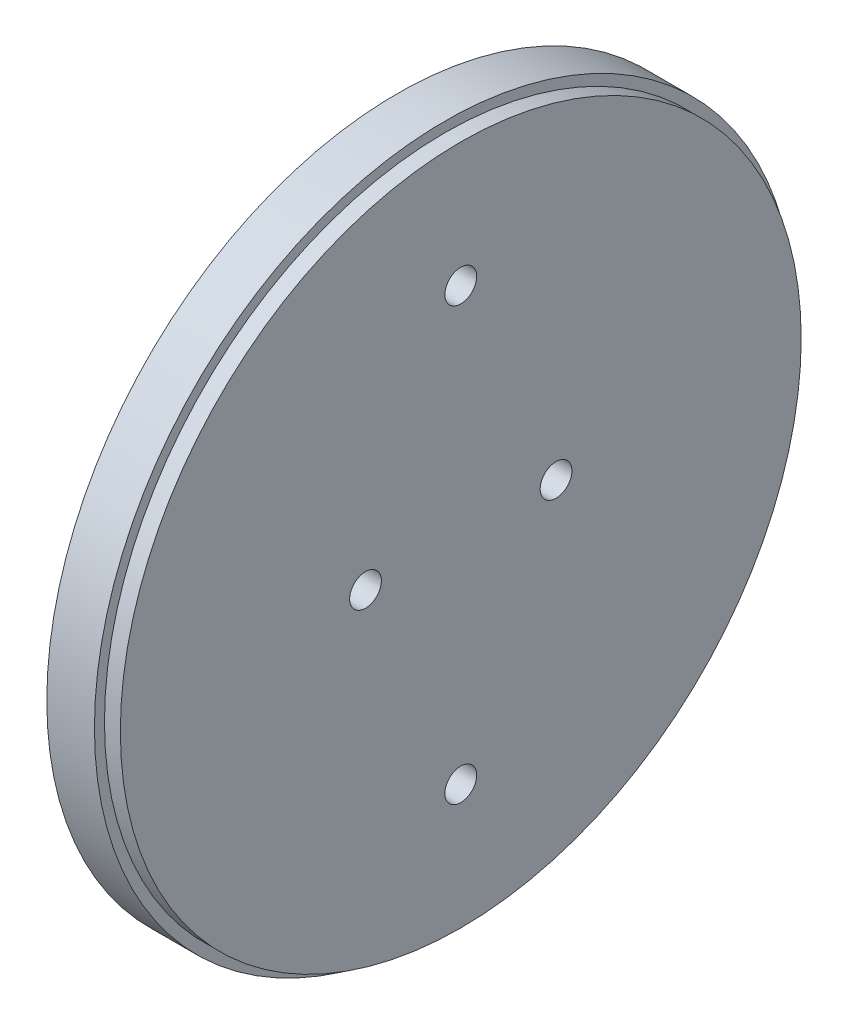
ISO-10303-21;
HEADER;
FILE_DESCRIPTION(('STEP AP214'),'2;1');
FILE_NAME('part.step','',(''),(''),'','','');
FILE_SCHEMA(('AUTOMOTIVE_DESIGN { 1 0 10303 214 1 1 1 1 }'));
ENDSEC;
DATA;
#1=APPLICATION_CONTEXT('core data for automotive mechanical design processes');
#2=APPLICATION_PROTOCOL_DEFINITION('international standard','automotive_design',2000,#1);
#3=PRODUCT_CONTEXT('',#1,'mechanical');
#4=PRODUCT('Part','Part','',(#3));
#5=PRODUCT_RELATED_PRODUCT_CATEGORY('part','',(#4));
#6=PRODUCT_DEFINITION_FORMATION('','',#4);
#7=PRODUCT_DEFINITION_CONTEXT('part definition',#1,'design');
#8=PRODUCT_DEFINITION('design','',#6,#7);
#9=PRODUCT_DEFINITION_SHAPE('','',#8);
#10=(LENGTH_UNIT() NAMED_UNIT(*) SI_UNIT(.MILLI.,.METRE.));
#11=(NAMED_UNIT(*) PLANE_ANGLE_UNIT() SI_UNIT($,.RADIAN.));
#12=(NAMED_UNIT(*) SI_UNIT($,.STERADIAN.) SOLID_ANGLE_UNIT());
#13=UNCERTAINTY_MEASURE_WITH_UNIT(LENGTH_MEASURE(1.E-05),#10,'distance_accuracy_value','');
#14=(GEOMETRIC_REPRESENTATION_CONTEXT(3) GLOBAL_UNCERTAINTY_ASSIGNED_CONTEXT((#13)) GLOBAL_UNIT_ASSIGNED_CONTEXT((#10,
#11,#12)) REPRESENTATION_CONTEXT('',''));
#15=CARTESIAN_POINT('',(0.,0.,0.));
#16=DIRECTION('',(0.,0.,1.));
#17=DIRECTION('',(1.,0.,0.));
#18=AXIS2_PLACEMENT_3D('',#15,#16,#17);
#19=CARTESIAN_POINT('',(9.525,0.,0.));
#20=DIRECTION('',(-1.,0.,0.));
#21=DIRECTION('',(0.,0.,1.));
#22=AXIS2_PLACEMENT_3D('',#19,#20,#21);
#23=CYLINDRICAL_SURFACE('',#22,70.0786);
#24=CARTESIAN_POINT('',(9.525,0.,0.));
#25=DIRECTION('',(1.,0.,0.));
#26=DIRECTION('',(0.,0.,-1.));
#27=AXIS2_PLACEMENT_3D('',#24,#25,#26);
#28=CIRCLE('',#27,70.0786);
#29=CARTESIAN_POINT('',(9.525,0.,70.0786));
#30=VERTEX_POINT('',#29);
#31=EDGE_CURVE('E49',#30,#30,#28,.T.);
#32=CARTESIAN_POINT('',(0.,0.,0.));
#33=DIRECTION('',(1.,0.,0.));
#34=DIRECTION('',(0.,0.,-1.));
#35=AXIS2_PLACEMENT_3D('',#32,#33,#34);
#36=CIRCLE('',#35,70.0786);
#37=CARTESIAN_POINT('',(0.,0.,70.0786));
#38=VERTEX_POINT('',#37);
#39=EDGE_CURVE('E44',#38,#38,#36,.T.);
#40=CARTESIAN_POINT('',(9.525,0.,70.0786));
#41=CARTESIAN_POINT('',(9.42578125,0.,70.0786));
#42=CARTESIAN_POINT('',(9.3265625,0.,70.0786));
#43=CARTESIAN_POINT('',(9.128125,0.,70.0786));
#44=CARTESIAN_POINT('',(9.02890625,0.,70.0786));
#45=CARTESIAN_POINT('',(8.83046875,0.,70.0786));
#46=CARTESIAN_POINT('',(8.73125,0.,70.0786));
#47=CARTESIAN_POINT('',(8.5328125,0.,70.0786));
#48=CARTESIAN_POINT('',(8.43359375,0.,70.0786));
#49=CARTESIAN_POINT('',(8.23515625,0.,70.0786));
#50=CARTESIAN_POINT('',(8.1359375,0.,70.0786));
#51=CARTESIAN_POINT('',(7.9375,0.,70.0786));
#52=CARTESIAN_POINT('',(7.83828125,0.,70.0786));
#53=CARTESIAN_POINT('',(7.63984375,0.,70.0786));
#54=CARTESIAN_POINT('',(7.540625,0.,70.0786));
#55=CARTESIAN_POINT('',(7.3421875,0.,70.0786));
#56=CARTESIAN_POINT('',(7.24296875,0.,70.0786));
#57=CARTESIAN_POINT('',(7.04453125,0.,70.0786));
#58=CARTESIAN_POINT('',(6.9453125,0.,70.0786));
#59=CARTESIAN_POINT('',(6.746875,0.,70.0786));
#60=CARTESIAN_POINT('',(6.64765625,0.,70.0786));
#61=CARTESIAN_POINT('',(6.44921875,0.,70.0786));
#62=CARTESIAN_POINT('',(6.35,0.,70.0786));
#63=CARTESIAN_POINT('',(6.1515625,0.,70.0786));
#64=CARTESIAN_POINT('',(6.05234375,0.,70.0786));
#65=CARTESIAN_POINT('',(5.85390625,0.,70.0786));
#66=CARTESIAN_POINT('',(5.7546875,0.,70.0786));
#67=CARTESIAN_POINT('',(5.55625,0.,70.0786));
#68=CARTESIAN_POINT('',(5.45703125,0.,70.0786));
#69=CARTESIAN_POINT('',(5.25859375,0.,70.0786));
#70=CARTESIAN_POINT('',(5.159375,0.,70.0786));
#71=CARTESIAN_POINT('',(4.9609375,0.,70.0786));
#72=CARTESIAN_POINT('',(4.86171875,0.,70.0786));
#73=CARTESIAN_POINT('',(4.66328125,0.,70.0786));
#74=CARTESIAN_POINT('',(4.5640625,0.,70.0786));
#75=CARTESIAN_POINT('',(4.365625,0.,70.0786));
#76=CARTESIAN_POINT('',(4.26640625,0.,70.0786));
#77=CARTESIAN_POINT('',(4.06796875,0.,70.0786));
#78=CARTESIAN_POINT('',(3.96875,0.,70.0786));
#79=CARTESIAN_POINT('',(3.7703125,0.,70.0786));
#80=CARTESIAN_POINT('',(3.67109375,0.,70.0786));
#81=CARTESIAN_POINT('',(3.47265625,0.,70.0786));
#82=CARTESIAN_POINT('',(3.3734375,0.,70.0786));
#83=CARTESIAN_POINT('',(3.175,0.,70.0786));
#84=CARTESIAN_POINT('',(3.07578125,0.,70.0786));
#85=CARTESIAN_POINT('',(2.87734375,0.,70.0786));
#86=CARTESIAN_POINT('',(2.778125,0.,70.0786));
#87=CARTESIAN_POINT('',(2.5796875,0.,70.0786));
#88=CARTESIAN_POINT('',(2.48046875,0.,70.0786));
#89=CARTESIAN_POINT('',(2.28203125,0.,70.0786));
#90=CARTESIAN_POINT('',(2.1828125,0.,70.0786));
#91=CARTESIAN_POINT('',(1.984375,0.,70.0786));
#92=CARTESIAN_POINT('',(1.88515625,0.,70.0786));
#93=CARTESIAN_POINT('',(1.68671875,0.,70.0786));
#94=CARTESIAN_POINT('',(1.5875,0.,70.0786));
#95=CARTESIAN_POINT('',(1.3890625,0.,70.0786));
#96=CARTESIAN_POINT('',(1.28984375,0.,70.0786));
#97=CARTESIAN_POINT('',(1.09140625,0.,70.0786));
#98=CARTESIAN_POINT('',(0.992187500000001,0.,70.0786));
#99=CARTESIAN_POINT('',(0.793750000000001,0.,70.0786));
#100=CARTESIAN_POINT('',(0.69453125,0.,70.0786));
#101=CARTESIAN_POINT('',(0.49609375,0.,70.0786));
#102=CARTESIAN_POINT('',(0.396875,0.,70.0786));
#103=CARTESIAN_POINT('',(0.1984375,0.,70.0786));
#104=CARTESIAN_POINT('',(0.0992187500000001,0.,70.0786));
#105=CARTESIAN_POINT('',(0.,0.,70.0786));
#106=B_SPLINE_CURVE_WITH_KNOTS('',3,(#40,#41,#42,#43,#44,#45,#46,#47,#48,#49,#50,#51,#52,#53,
#54,#55,#56,#57,#58,#59,#60,#61,#62,#63,#64,#65,#66,#67,#68,#69,#70,#71,#72,#73,#74,#75,#76,#77,
#78,#79,#80,#81,#82,#83,#84,#85,#86,#87,#88,#89,#90,#91,#92,#93,#94,#95,#96,#97,#98,#99,#100,
#101,#102,#103,#104,#105),.UNSPECIFIED.,.F.,.F.,(4,2,2,2,2,2,2,2,2,2,2,2,2,2,2,2,2,2,2,2,2,2,2,
2,2,2,2,2,2,2,2,2,4),(0.,0.29765625,0.5953125,0.892968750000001,1.190625,1.48828125,1.7859375,
2.08359375,2.38125,2.67890625,2.9765625,3.27421875,3.571875,3.86953125,4.1671875,4.46484375,
4.7625,5.06015625,5.3578125,5.65546875,5.953125,6.25078125,6.5484375,6.84609375,7.14375,
7.44140625,7.7390625,8.03671875,8.334375,8.63203125,8.9296875,9.22734375,9.525),.UNSPECIFIED.);
#107=EDGE_CURVE('BSEAM41',#30,#38,#106,.T.);
#108=ORIENTED_EDGE('',*,*,#31,.F.);
#109=ORIENTED_EDGE('',*,*,#39,.T.);
#110=ORIENTED_EDGE('',*,*,#107,.T.);
#111=ORIENTED_EDGE('',*,*,#107,.F.);
#112=EDGE_LOOP('',(#108,#110,#109,#111));
#113=FACE_BOUND('',#112,.T.);
#114=ADVANCED_FACE('F41',(#113),#23,.T.);
#115=CARTESIAN_POINT('',(9.525,0.,0.));
#116=DIRECTION('',(1.,0.,0.));
#117=DIRECTION('',(0.,0.,-1.));
#118=AXIS2_PLACEMENT_3D('',#115,#116,#117);
#119=PLANE('',#118);
#120=CARTESIAN_POINT('',(9.525,0.,0.));
#121=DIRECTION('',(1.,0.,0.));
#122=DIRECTION('',(0.,0.,-1.));
#123=AXIS2_PLACEMENT_3D('',#120,#121,#122);
#124=CIRCLE('',#123,68.072);
#125=CARTESIAN_POINT('',(9.525,0.,-68.072));
#126=VERTEX_POINT('',#125);
#127=EDGE_CURVE('E10',#126,#126,#124,.T.);
#128=ORIENTED_EDGE('',*,*,#127,.F.);
#129=EDGE_LOOP('',(#128));
#130=FACE_BOUND('',#129,.T.);
#131=ORIENTED_EDGE('',*,*,#31,.T.);
#132=EDGE_LOOP('',(#131));
#133=FACE_BOUND('',#132,.T.);
#134=ADVANCED_FACE('F115',(#130,#133),#119,.T.);
#135=CARTESIAN_POINT('',(0.,0.,0.));
#136=DIRECTION('',(1.,0.,0.));
#137=DIRECTION('',(0.,0.,-1.));
#138=AXIS2_PLACEMENT_3D('',#135,#136,#137);
#139=PLANE('',#138);
#140=CARTESIAN_POINT('',(0.,0.,-19.05));
#141=DIRECTION('',(1.,0.,0.));
#142=DIRECTION('',(0.,0.,-1.));
#143=AXIS2_PLACEMENT_3D('',#140,#141,#142);
#144=CIRCLE('',#143,3.175);
#145=CARTESIAN_POINT('',(0.,0.,-22.225));
#146=VERTEX_POINT('',#145);
#147=EDGE_CURVE('E60',#146,#146,#144,.T.);
#148=ORIENTED_EDGE('',*,*,#147,.T.);
#149=EDGE_LOOP('',(#148));
#150=FACE_BOUND('',#149,.T.);
#151=CARTESIAN_POINT('',(0.,0.,19.05));
#152=DIRECTION('',(1.,0.,0.));
#153=DIRECTION('',(0.,0.,1.));
#154=AXIS2_PLACEMENT_3D('',#151,#152,#153);
#155=CIRCLE('',#154,3.175);
#156=CARTESIAN_POINT('',(0.,0.,15.875));
#157=VERTEX_POINT('',#156);
#158=EDGE_CURVE('E74',#157,#157,#155,.T.);
#159=ORIENTED_EDGE('',*,*,#158,.T.);
#160=EDGE_LOOP('',(#159));
#161=FACE_BOUND('',#160,.T.);
#162=CARTESIAN_POINT('',(0.,43.18,0.));
#163=DIRECTION('',(1.,0.,0.));
#164=DIRECTION('',(0.,0.,-1.));
#165=AXIS2_PLACEMENT_3D('',#162,#163,#164);
#166=CIRCLE('',#165,3.175);
#167=CARTESIAN_POINT('',(0.,43.18,-3.175));
#168=VERTEX_POINT('',#167);
#169=EDGE_CURVE('E65',#168,#168,#166,.T.);
#170=ORIENTED_EDGE('',*,*,#169,.T.);
#171=EDGE_LOOP('',(#170));
#172=FACE_BOUND('',#171,.T.);
#173=CARTESIAN_POINT('',(0.,-43.18,0.));
#174=DIRECTION('',(1.,0.,0.));
#175=DIRECTION('',(0.,0.,1.));
#176=AXIS2_PLACEMENT_3D('',#173,#174,#175);
#177=CIRCLE('',#176,3.175);
#178=CARTESIAN_POINT('',(0.,-43.18,-3.175));
#179=VERTEX_POINT('',#178);
#180=EDGE_CURVE('E66',#179,#179,#177,.T.);
#181=ORIENTED_EDGE('',*,*,#180,.T.);
#182=EDGE_LOOP('',(#181));
#183=FACE_BOUND('',#182,.T.);
#184=ORIENTED_EDGE('',*,*,#39,.F.);
#185=EDGE_LOOP('',(#184));
#186=FACE_BOUND('',#185,.T.);
#187=ADVANCED_FACE('F110',(#150,#161,#172,#183,#186),#139,.F.);
#188=CARTESIAN_POINT('',(12.7,0.,0.));
#189=DIRECTION('',(-1.,0.,0.));
#190=DIRECTION('',(0.,0.,1.));
#191=AXIS2_PLACEMENT_3D('',#188,#189,#190);
#192=CYLINDRICAL_SURFACE('',#191,68.072);
#193=CARTESIAN_POINT('',(12.7,0.,0.));
#194=DIRECTION('',(1.,0.,0.));
#195=DIRECTION('',(0.,0.,-1.));
#196=AXIS2_PLACEMENT_3D('',#193,#194,#195);
#197=CIRCLE('',#196,68.072);
#198=CARTESIAN_POINT('',(12.7,0.,-68.072));
#199=VERTEX_POINT('',#198);
#200=EDGE_CURVE('E56',#199,#199,#197,.T.);
#201=ORIENTED_EDGE('',*,*,#200,.F.);
#202=EDGE_LOOP('',(#201));
#203=FACE_BOUND('',#202,.T.);
#204=ORIENTED_EDGE('',*,*,#127,.T.);
#205=EDGE_LOOP('',(#204));
#206=FACE_BOUND('',#205,.T.);
#207=ADVANCED_FACE('F99',(#203,#206),#192,.T.);
#208=CARTESIAN_POINT('',(12.7,0.,0.));
#209=DIRECTION('',(1.,0.,0.));
#210=DIRECTION('',(0.,0.,-1.));
#211=AXIS2_PLACEMENT_3D('',#208,#209,#210);
#212=PLANE('',#211);
#213=CARTESIAN_POINT('',(12.7,0.,-19.05));
#214=DIRECTION('',(1.,0.,0.));
#215=DIRECTION('',(0.,0.,-1.));
#216=AXIS2_PLACEMENT_3D('',#213,#214,#215);
#217=CIRCLE('',#216,3.175);
#218=CARTESIAN_POINT('',(12.7,0.,-22.225));
#219=VERTEX_POINT('',#218);
#220=EDGE_CURVE('E82',#219,#219,#217,.T.);
#221=ORIENTED_EDGE('',*,*,#220,.F.);
#222=EDGE_LOOP('',(#221));
#223=FACE_BOUND('',#222,.T.);
#224=CARTESIAN_POINT('',(12.7,0.,19.05));
#225=DIRECTION('',(1.,0.,0.));
#226=DIRECTION('',(0.,0.,1.));
#227=AXIS2_PLACEMENT_3D('',#224,#225,#226);
#228=CIRCLE('',#227,3.175);
#229=CARTESIAN_POINT('',(12.7,0.,15.875));
#230=VERTEX_POINT('',#229);
#231=EDGE_CURVE('E78',#230,#230,#228,.T.);
#232=ORIENTED_EDGE('',*,*,#231,.F.);
#233=EDGE_LOOP('',(#232));
#234=FACE_BOUND('',#233,.T.);
#235=CARTESIAN_POINT('',(12.7,43.18,0.));
#236=DIRECTION('',(1.,0.,0.));
#237=DIRECTION('',(0.,0.,-1.));
#238=AXIS2_PLACEMENT_3D('',#235,#236,#237);
#239=CIRCLE('',#238,3.175);
#240=CARTESIAN_POINT('',(12.7,43.18,-3.175));
#241=VERTEX_POINT('',#240);
#242=EDGE_CURVE('E70',#241,#241,#239,.T.);
#243=ORIENTED_EDGE('',*,*,#242,.F.);
#244=EDGE_LOOP('',(#243));
#245=FACE_BOUND('',#244,.T.);
#246=CARTESIAN_POINT('',(12.7,-43.18,0.));
#247=DIRECTION('',(1.,0.,0.));
#248=DIRECTION('',(0.,0.,1.));
#249=AXIS2_PLACEMENT_3D('',#246,#247,#248);
#250=CIRCLE('',#249,3.175);
#251=CARTESIAN_POINT('',(12.7,-43.18,-3.175));
#252=VERTEX_POINT('',#251);
#253=EDGE_CURVE('E61',#252,#252,#250,.T.);
#254=ORIENTED_EDGE('',*,*,#253,.F.);
#255=EDGE_LOOP('',(#254));
#256=FACE_BOUND('',#255,.T.);
#257=ORIENTED_EDGE('',*,*,#200,.T.);
#258=EDGE_LOOP('',(#257));
#259=FACE_BOUND('',#258,.T.);
#260=ADVANCED_FACE('F95',(#223,#234,#245,#256,#259),#212,.T.);
#261=CARTESIAN_POINT('',(0.,-43.18,0.));
#262=DIRECTION('',(1.,0.,0.));
#263=DIRECTION('',(0.,0.,-1.));
#264=AXIS2_PLACEMENT_3D('',#261,#262,#263);
#265=CYLINDRICAL_SURFACE('',#264,3.175);
#266=CARTESIAN_POINT('',(0.,-43.18,-3.175));
#267=CARTESIAN_POINT('',(0.132291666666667,-43.18,-3.175));
#268=CARTESIAN_POINT('',(0.264583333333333,-43.18,-3.175));
#269=CARTESIAN_POINT('',(0.529166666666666,-43.18,-3.175));
#270=CARTESIAN_POINT('',(0.661458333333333,-43.18,-3.175));
#271=CARTESIAN_POINT('',(0.926041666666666,-43.18,-3.175));
#272=CARTESIAN_POINT('',(1.05833333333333,-43.18,-3.175));
#273=CARTESIAN_POINT('',(1.32291666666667,-43.18,-3.175));
#274=CARTESIAN_POINT('',(1.45520833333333,-43.18,-3.175));
#275=CARTESIAN_POINT('',(1.71979166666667,-43.18,-3.175));
#276=CARTESIAN_POINT('',(1.85208333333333,-43.18,-3.175));
#277=CARTESIAN_POINT('',(2.11666666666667,-43.18,-3.175));
#278=CARTESIAN_POINT('',(2.24895833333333,-43.18,-3.175));
#279=CARTESIAN_POINT('',(2.51354166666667,-43.18,-3.175));
#280=CARTESIAN_POINT('',(2.64583333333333,-43.18,-3.175));
#281=CARTESIAN_POINT('',(2.91041666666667,-43.18,-3.175));
#282=CARTESIAN_POINT('',(3.04270833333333,-43.18,-3.175));
#283=CARTESIAN_POINT('',(3.30729166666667,-43.18,-3.175));
#284=CARTESIAN_POINT('',(3.43958333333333,-43.18,-3.175));
#285=CARTESIAN_POINT('',(3.70416666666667,-43.18,-3.175));
#286=CARTESIAN_POINT('',(3.83645833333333,-43.18,-3.175));
#287=CARTESIAN_POINT('',(4.10104166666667,-43.18,-3.175));
#288=CARTESIAN_POINT('',(4.23333333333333,-43.18,-3.175));
#289=CARTESIAN_POINT('',(4.49791666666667,-43.18,-3.175));
#290=CARTESIAN_POINT('',(4.63020833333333,-43.18,-3.175));
#291=CARTESIAN_POINT('',(4.89479166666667,-43.18,-3.175));
#292=CARTESIAN_POINT('',(5.02708333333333,-43.18,-3.175));
#293=CARTESIAN_POINT('',(5.29166666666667,-43.18,-3.175));
#294=CARTESIAN_POINT('',(5.42395833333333,-43.18,-3.175));
#295=CARTESIAN_POINT('',(5.68854166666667,-43.18,-3.175));
#296=CARTESIAN_POINT('',(5.82083333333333,-43.18,-3.175));
#297=CARTESIAN_POINT('',(6.08541666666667,-43.18,-3.175));
#298=CARTESIAN_POINT('',(6.21770833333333,-43.18,-3.175));
#299=CARTESIAN_POINT('',(6.48229166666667,-43.18,-3.175));
#300=CARTESIAN_POINT('',(6.61458333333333,-43.18,-3.175));
#301=CARTESIAN_POINT('',(6.87916666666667,-43.18,-3.175));
#302=CARTESIAN_POINT('',(7.01145833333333,-43.18,-3.175));
#303=CARTESIAN_POINT('',(7.27604166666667,-43.18,-3.175));
#304=CARTESIAN_POINT('',(7.40833333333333,-43.18,-3.175));
#305=CARTESIAN_POINT('',(7.67291666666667,-43.18,-3.175));
#306=CARTESIAN_POINT('',(7.80520833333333,-43.18,-3.175));
#307=CARTESIAN_POINT('',(8.06979166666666,-43.18,-3.175));
#308=CARTESIAN_POINT('',(8.20208333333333,-43.18,-3.175));
#309=CARTESIAN_POINT('',(8.46666666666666,-43.18,-3.175));
#310=CARTESIAN_POINT('',(8.59895833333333,-43.18,-3.175));
#311=CARTESIAN_POINT('',(8.86354166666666,-43.18,-3.175));
#312=CARTESIAN_POINT('',(8.99583333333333,-43.18,-3.175));
#313=CARTESIAN_POINT('',(9.26041666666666,-43.18,-3.175));
#314=CARTESIAN_POINT('',(9.39270833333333,-43.18,-3.175));
#315=CARTESIAN_POINT('',(9.65729166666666,-43.18,-3.175));
#316=CARTESIAN_POINT('',(9.78958333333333,-43.18,-3.175));
#317=CARTESIAN_POINT('',(10.0541666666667,-43.18,-3.175));
#318=CARTESIAN_POINT('',(10.1864583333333,-43.18,-3.175));
#319=CARTESIAN_POINT('',(10.4510416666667,-43.18,-3.175));
#320=CARTESIAN_POINT('',(10.5833333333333,-43.18,-3.175));
#321=CARTESIAN_POINT('',(10.8479166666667,-43.18,-3.175));
#322=CARTESIAN_POINT('',(10.9802083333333,-43.18,-3.175));
#323=CARTESIAN_POINT('',(11.2447916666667,-43.18,-3.175));
#324=CARTESIAN_POINT('',(11.3770833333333,-43.18,-3.175));
#325=CARTESIAN_POINT('',(11.6416666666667,-43.18,-3.175));
#326=CARTESIAN_POINT('',(11.7739583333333,-43.18,-3.175));
#327=CARTESIAN_POINT('',(12.0385416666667,-43.18,-3.175));
#328=CARTESIAN_POINT('',(12.1708333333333,-43.18,-3.175));
#329=CARTESIAN_POINT('',(12.4354166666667,-43.18,-3.175));
#330=CARTESIAN_POINT('',(12.5677083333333,-43.18,-3.175));
#331=CARTESIAN_POINT('',(12.7,-43.18,-3.175));
#332=B_SPLINE_CURVE_WITH_KNOTS('',3,(#266,#267,#268,#269,#270,#271,#272,#273,#274,#275,#276,
#277,#278,#279,#280,#281,#282,#283,#284,#285,#286,#287,#288,#289,#290,#291,#292,#293,#294,#295,
#296,#297,#298,#299,#300,#301,#302,#303,#304,#305,#306,#307,#308,#309,#310,#311,#312,#313,#314,
#315,#316,#317,#318,#319,#320,#321,#322,#323,#324,#325,#326,#327,#328,#329,#330,#331),
.UNSPECIFIED.,.F.,.F.,(4,2,2,2,2,2,2,2,2,2,2,2,2,2,2,2,2,2,2,2,2,2,2,2,2,2,2,2,2,2,2,2,4),(0.,
0.396875,0.79375,1.190625,1.5875,1.984375,2.38125,2.778125,3.175,3.571875,3.96875,4.365625,
4.7625,5.159375,5.55625,5.953125,6.35,6.746875,7.14375,7.540625,7.9375,8.334375,8.73125,
9.128125,9.525,9.921875,10.31875,10.715625,11.1125,11.509375,11.90625,12.303125,12.7),.UNSPECIFIED.);
#333=EDGE_CURVE('BSEAM98',#179,#252,#332,.T.);
#334=ORIENTED_EDGE('',*,*,#180,.F.);
#335=ORIENTED_EDGE('',*,*,#253,.T.);
#336=ORIENTED_EDGE('',*,*,#333,.T.);
#337=ORIENTED_EDGE('',*,*,#333,.F.);
#338=EDGE_LOOP('',(#334,#336,#335,#337));
#339=FACE_BOUND('',#338,.T.);
#340=ADVANCED_FACE('F98',(#339),#265,.F.);
#341=CARTESIAN_POINT('',(0.,43.18,0.));
#342=DIRECTION('',(1.,0.,0.));
#343=DIRECTION('',(0.,0.,-1.));
#344=AXIS2_PLACEMENT_3D('',#341,#342,#343);
#345=CYLINDRICAL_SURFACE('',#344,3.175);
#346=CARTESIAN_POINT('',(0.,43.18,-3.175));
#347=CARTESIAN_POINT('',(0.132291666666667,43.18,-3.175));
#348=CARTESIAN_POINT('',(0.264583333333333,43.18,-3.175));
#349=CARTESIAN_POINT('',(0.529166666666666,43.18,-3.175));
#350=CARTESIAN_POINT('',(0.661458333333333,43.18,-3.175));
#351=CARTESIAN_POINT('',(0.926041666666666,43.18,-3.175));
#352=CARTESIAN_POINT('',(1.05833333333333,43.18,-3.175));
#353=CARTESIAN_POINT('',(1.32291666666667,43.18,-3.175));
#354=CARTESIAN_POINT('',(1.45520833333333,43.18,-3.175));
#355=CARTESIAN_POINT('',(1.71979166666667,43.18,-3.175));
#356=CARTESIAN_POINT('',(1.85208333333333,43.18,-3.175));
#357=CARTESIAN_POINT('',(2.11666666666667,43.18,-3.175));
#358=CARTESIAN_POINT('',(2.24895833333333,43.18,-3.175));
#359=CARTESIAN_POINT('',(2.51354166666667,43.18,-3.175));
#360=CARTESIAN_POINT('',(2.64583333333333,43.18,-3.175));
#361=CARTESIAN_POINT('',(2.91041666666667,43.18,-3.175));
#362=CARTESIAN_POINT('',(3.04270833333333,43.18,-3.175));
#363=CARTESIAN_POINT('',(3.30729166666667,43.18,-3.175));
#364=CARTESIAN_POINT('',(3.43958333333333,43.18,-3.175));
#365=CARTESIAN_POINT('',(3.70416666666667,43.18,-3.175));
#366=CARTESIAN_POINT('',(3.83645833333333,43.18,-3.175));
#367=CARTESIAN_POINT('',(4.10104166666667,43.18,-3.175));
#368=CARTESIAN_POINT('',(4.23333333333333,43.18,-3.175));
#369=CARTESIAN_POINT('',(4.49791666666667,43.18,-3.175));
#370=CARTESIAN_POINT('',(4.63020833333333,43.18,-3.175));
#371=CARTESIAN_POINT('',(4.89479166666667,43.18,-3.175));
#372=CARTESIAN_POINT('',(5.02708333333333,43.18,-3.175));
#373=CARTESIAN_POINT('',(5.29166666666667,43.18,-3.175));
#374=CARTESIAN_POINT('',(5.42395833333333,43.18,-3.175));
#375=CARTESIAN_POINT('',(5.68854166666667,43.18,-3.175));
#376=CARTESIAN_POINT('',(5.82083333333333,43.18,-3.175));
#377=CARTESIAN_POINT('',(6.08541666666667,43.18,-3.175));
#378=CARTESIAN_POINT('',(6.21770833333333,43.18,-3.175));
#379=CARTESIAN_POINT('',(6.48229166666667,43.18,-3.175));
#380=CARTESIAN_POINT('',(6.61458333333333,43.18,-3.175));
#381=CARTESIAN_POINT('',(6.87916666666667,43.18,-3.175));
#382=CARTESIAN_POINT('',(7.01145833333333,43.18,-3.175));
#383=CARTESIAN_POINT('',(7.27604166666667,43.18,-3.175));
#384=CARTESIAN_POINT('',(7.40833333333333,43.18,-3.175));
#385=CARTESIAN_POINT('',(7.67291666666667,43.18,-3.175));
#386=CARTESIAN_POINT('',(7.80520833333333,43.18,-3.175));
#387=CARTESIAN_POINT('',(8.06979166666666,43.18,-3.175));
#388=CARTESIAN_POINT('',(8.20208333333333,43.18,-3.175));
#389=CARTESIAN_POINT('',(8.46666666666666,43.18,-3.175));
#390=CARTESIAN_POINT('',(8.59895833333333,43.18,-3.175));
#391=CARTESIAN_POINT('',(8.86354166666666,43.18,-3.175));
#392=CARTESIAN_POINT('',(8.99583333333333,43.18,-3.175));
#393=CARTESIAN_POINT('',(9.26041666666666,43.18,-3.175));
#394=CARTESIAN_POINT('',(9.39270833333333,43.18,-3.175));
#395=CARTESIAN_POINT('',(9.65729166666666,43.18,-3.175));
#396=CARTESIAN_POINT('',(9.78958333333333,43.18,-3.175));
#397=CARTESIAN_POINT('',(10.0541666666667,43.18,-3.175));
#398=CARTESIAN_POINT('',(10.1864583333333,43.18,-3.175));
#399=CARTESIAN_POINT('',(10.4510416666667,43.18,-3.175));
#400=CARTESIAN_POINT('',(10.5833333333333,43.18,-3.175));
#401=CARTESIAN_POINT('',(10.8479166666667,43.18,-3.175));
#402=CARTESIAN_POINT('',(10.9802083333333,43.18,-3.175));
#403=CARTESIAN_POINT('',(11.2447916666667,43.18,-3.175));
#404=CARTESIAN_POINT('',(11.3770833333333,43.18,-3.175));
#405=CARTESIAN_POINT('',(11.6416666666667,43.18,-3.175));
#406=CARTESIAN_POINT('',(11.7739583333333,43.18,-3.175));
#407=CARTESIAN_POINT('',(12.0385416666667,43.18,-3.175));
#408=CARTESIAN_POINT('',(12.1708333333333,43.18,-3.175));
#409=CARTESIAN_POINT('',(12.4354166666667,43.18,-3.175));
#410=CARTESIAN_POINT('',(12.5677083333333,43.18,-3.175));
#411=CARTESIAN_POINT('',(12.7,43.18,-3.175));
#412=B_SPLINE_CURVE_WITH_KNOTS('',3,(#346,#347,#348,#349,#350,#351,#352,#353,#354,#355,#356,
#357,#358,#359,#360,#361,#362,#363,#364,#365,#366,#367,#368,#369,#370,#371,#372,#373,#374,#375,
#376,#377,#378,#379,#380,#381,#382,#383,#384,#385,#386,#387,#388,#389,#390,#391,#392,#393,#394,
#395,#396,#397,#398,#399,#400,#401,#402,#403,#404,#405,#406,#407,#408,#409,#410,#411),
.UNSPECIFIED.,.F.,.F.,(4,2,2,2,2,2,2,2,2,2,2,2,2,2,2,2,2,2,2,2,2,2,2,2,2,2,2,2,2,2,2,2,4),(0.,
0.396875,0.79375,1.190625,1.5875,1.984375,2.38125,2.778125,3.175,3.571875,3.96875,4.365625,
4.7625,5.159375,5.55625,5.953125,6.35,6.746875,7.14375,7.540625,7.9375,8.334375,8.73125,
9.128125,9.525,9.921875,10.31875,10.715625,11.1125,11.509375,11.90625,12.303125,12.7),.UNSPECIFIED.);
#413=EDGE_CURVE('BSEAM156',#168,#241,#412,.T.);
#414=ORIENTED_EDGE('',*,*,#169,.F.);
#415=ORIENTED_EDGE('',*,*,#242,.T.);
#416=ORIENTED_EDGE('',*,*,#413,.T.);
#417=ORIENTED_EDGE('',*,*,#413,.F.);
#418=EDGE_LOOP('',(#414,#416,#415,#417));
#419=FACE_BOUND('',#418,.T.);
#420=ADVANCED_FACE('F156',(#419),#345,.F.);
#421=CARTESIAN_POINT('',(0.,0.,19.05));
#422=DIRECTION('',(1.,0.,0.));
#423=DIRECTION('',(0.,0.,-1.));
#424=AXIS2_PLACEMENT_3D('',#421,#422,#423);
#425=CYLINDRICAL_SURFACE('',#424,3.175);
#426=CARTESIAN_POINT('',(0.,0.,15.875));
#427=CARTESIAN_POINT('',(0.132291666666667,0.,15.875));
#428=CARTESIAN_POINT('',(0.264583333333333,0.,15.875));
#429=CARTESIAN_POINT('',(0.529166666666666,0.,15.875));
#430=CARTESIAN_POINT('',(0.661458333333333,0.,15.875));
#431=CARTESIAN_POINT('',(0.926041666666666,0.,15.875));
#432=CARTESIAN_POINT('',(1.05833333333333,0.,15.875));
#433=CARTESIAN_POINT('',(1.32291666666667,0.,15.875));
#434=CARTESIAN_POINT('',(1.45520833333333,0.,15.875));
#435=CARTESIAN_POINT('',(1.71979166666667,0.,15.875));
#436=CARTESIAN_POINT('',(1.85208333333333,0.,15.875));
#437=CARTESIAN_POINT('',(2.11666666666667,0.,15.875));
#438=CARTESIAN_POINT('',(2.24895833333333,0.,15.875));
#439=CARTESIAN_POINT('',(2.51354166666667,0.,15.875));
#440=CARTESIAN_POINT('',(2.64583333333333,0.,15.875));
#441=CARTESIAN_POINT('',(2.91041666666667,0.,15.875));
#442=CARTESIAN_POINT('',(3.04270833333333,0.,15.875));
#443=CARTESIAN_POINT('',(3.30729166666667,0.,15.875));
#444=CARTESIAN_POINT('',(3.43958333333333,0.,15.875));
#445=CARTESIAN_POINT('',(3.70416666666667,0.,15.875));
#446=CARTESIAN_POINT('',(3.83645833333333,0.,15.875));
#447=CARTESIAN_POINT('',(4.10104166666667,0.,15.875));
#448=CARTESIAN_POINT('',(4.23333333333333,0.,15.875));
#449=CARTESIAN_POINT('',(4.49791666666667,0.,15.875));
#450=CARTESIAN_POINT('',(4.63020833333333,0.,15.875));
#451=CARTESIAN_POINT('',(4.89479166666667,0.,15.875));
#452=CARTESIAN_POINT('',(5.02708333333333,0.,15.875));
#453=CARTESIAN_POINT('',(5.29166666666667,0.,15.875));
#454=CARTESIAN_POINT('',(5.42395833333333,0.,15.875));
#455=CARTESIAN_POINT('',(5.68854166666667,0.,15.875));
#456=CARTESIAN_POINT('',(5.82083333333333,0.,15.875));
#457=CARTESIAN_POINT('',(6.08541666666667,0.,15.875));
#458=CARTESIAN_POINT('',(6.21770833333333,0.,15.875));
#459=CARTESIAN_POINT('',(6.48229166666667,0.,15.875));
#460=CARTESIAN_POINT('',(6.61458333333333,0.,15.875));
#461=CARTESIAN_POINT('',(6.87916666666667,0.,15.875));
#462=CARTESIAN_POINT('',(7.01145833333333,0.,15.875));
#463=CARTESIAN_POINT('',(7.27604166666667,0.,15.875));
#464=CARTESIAN_POINT('',(7.40833333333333,0.,15.875));
#465=CARTESIAN_POINT('',(7.67291666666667,0.,15.875));
#466=CARTESIAN_POINT('',(7.80520833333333,0.,15.875));
#467=CARTESIAN_POINT('',(8.06979166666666,0.,15.875));
#468=CARTESIAN_POINT('',(8.20208333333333,0.,15.875));
#469=CARTESIAN_POINT('',(8.46666666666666,0.,15.875));
#470=CARTESIAN_POINT('',(8.59895833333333,0.,15.875));
#471=CARTESIAN_POINT('',(8.86354166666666,0.,15.875));
#472=CARTESIAN_POINT('',(8.99583333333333,0.,15.875));
#473=CARTESIAN_POINT('',(9.26041666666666,0.,15.875));
#474=CARTESIAN_POINT('',(9.39270833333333,0.,15.875));
#475=CARTESIAN_POINT('',(9.65729166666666,0.,15.875));
#476=CARTESIAN_POINT('',(9.78958333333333,0.,15.875));
#477=CARTESIAN_POINT('',(10.0541666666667,0.,15.875));
#478=CARTESIAN_POINT('',(10.1864583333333,0.,15.875));
#479=CARTESIAN_POINT('',(10.4510416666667,0.,15.875));
#480=CARTESIAN_POINT('',(10.5833333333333,0.,15.875));
#481=CARTESIAN_POINT('',(10.8479166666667,0.,15.875));
#482=CARTESIAN_POINT('',(10.9802083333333,0.,15.875));
#483=CARTESIAN_POINT('',(11.2447916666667,0.,15.875));
#484=CARTESIAN_POINT('',(11.3770833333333,0.,15.875));
#485=CARTESIAN_POINT('',(11.6416666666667,0.,15.875));
#486=CARTESIAN_POINT('',(11.7739583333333,0.,15.875));
#487=CARTESIAN_POINT('',(12.0385416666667,0.,15.875));
#488=CARTESIAN_POINT('',(12.1708333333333,0.,15.875));
#489=CARTESIAN_POINT('',(12.4354166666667,0.,15.875));
#490=CARTESIAN_POINT('',(12.5677083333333,0.,15.875));
#491=CARTESIAN_POINT('',(12.7,0.,15.875));
#492=B_SPLINE_CURVE_WITH_KNOTS('',3,(#426,#427,#428,#429,#430,#431,#432,#433,#434,#435,#436,
#437,#438,#439,#440,#441,#442,#443,#444,#445,#446,#447,#448,#449,#450,#451,#452,#453,#454,#455,
#456,#457,#458,#459,#460,#461,#462,#463,#464,#465,#466,#467,#468,#469,#470,#471,#472,#473,#474,
#475,#476,#477,#478,#479,#480,#481,#482,#483,#484,#485,#486,#487,#488,#489,#490,#491),
.UNSPECIFIED.,.F.,.F.,(4,2,2,2,2,2,2,2,2,2,2,2,2,2,2,2,2,2,2,2,2,2,2,2,2,2,2,2,2,2,2,2,4),(0.,
0.396875,0.79375,1.190625,1.5875,1.984375,2.38125,2.778125,3.175,3.571875,3.96875,4.365625,
4.7625,5.159375,5.55625,5.953125,6.35,6.746875,7.14375,7.540625,7.9375,8.334375,8.73125,
9.128125,9.525,9.921875,10.31875,10.715625,11.1125,11.509375,11.90625,12.303125,12.7),.UNSPECIFIED.);
#493=EDGE_CURVE('BSEAM167',#157,#230,#492,.T.);
#494=ORIENTED_EDGE('',*,*,#158,.F.);
#495=ORIENTED_EDGE('',*,*,#231,.T.);
#496=ORIENTED_EDGE('',*,*,#493,.T.);
#497=ORIENTED_EDGE('',*,*,#493,.F.);
#498=EDGE_LOOP('',(#494,#496,#495,#497));
#499=FACE_BOUND('',#498,.T.);
#500=ADVANCED_FACE('F167',(#499),#425,.F.);
#501=CARTESIAN_POINT('',(0.,0.,-19.05));
#502=DIRECTION('',(1.,0.,0.));
#503=DIRECTION('',(0.,0.,-1.));
#504=AXIS2_PLACEMENT_3D('',#501,#502,#503);
#505=CYLINDRICAL_SURFACE('',#504,3.175);
#506=CARTESIAN_POINT('',(0.,0.,-22.225));
#507=CARTESIAN_POINT('',(0.132291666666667,0.,-22.225));
#508=CARTESIAN_POINT('',(0.264583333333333,0.,-22.225));
#509=CARTESIAN_POINT('',(0.529166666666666,0.,-22.225));
#510=CARTESIAN_POINT('',(0.661458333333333,0.,-22.225));
#511=CARTESIAN_POINT('',(0.926041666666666,0.,-22.225));
#512=CARTESIAN_POINT('',(1.05833333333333,0.,-22.225));
#513=CARTESIAN_POINT('',(1.32291666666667,0.,-22.225));
#514=CARTESIAN_POINT('',(1.45520833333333,0.,-22.225));
#515=CARTESIAN_POINT('',(1.71979166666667,0.,-22.225));
#516=CARTESIAN_POINT('',(1.85208333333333,0.,-22.225));
#517=CARTESIAN_POINT('',(2.11666666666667,0.,-22.225));
#518=CARTESIAN_POINT('',(2.24895833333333,0.,-22.225));
#519=CARTESIAN_POINT('',(2.51354166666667,0.,-22.225));
#520=CARTESIAN_POINT('',(2.64583333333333,0.,-22.225));
#521=CARTESIAN_POINT('',(2.91041666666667,0.,-22.225));
#522=CARTESIAN_POINT('',(3.04270833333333,0.,-22.225));
#523=CARTESIAN_POINT('',(3.30729166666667,0.,-22.225));
#524=CARTESIAN_POINT('',(3.43958333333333,0.,-22.225));
#525=CARTESIAN_POINT('',(3.70416666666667,0.,-22.225));
#526=CARTESIAN_POINT('',(3.83645833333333,0.,-22.225));
#527=CARTESIAN_POINT('',(4.10104166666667,0.,-22.225));
#528=CARTESIAN_POINT('',(4.23333333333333,0.,-22.225));
#529=CARTESIAN_POINT('',(4.49791666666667,0.,-22.225));
#530=CARTESIAN_POINT('',(4.63020833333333,0.,-22.225));
#531=CARTESIAN_POINT('',(4.89479166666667,0.,-22.225));
#532=CARTESIAN_POINT('',(5.02708333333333,0.,-22.225));
#533=CARTESIAN_POINT('',(5.29166666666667,0.,-22.225));
#534=CARTESIAN_POINT('',(5.42395833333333,0.,-22.225));
#535=CARTESIAN_POINT('',(5.68854166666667,0.,-22.225));
#536=CARTESIAN_POINT('',(5.82083333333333,0.,-22.225));
#537=CARTESIAN_POINT('',(6.08541666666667,0.,-22.225));
#538=CARTESIAN_POINT('',(6.21770833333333,0.,-22.225));
#539=CARTESIAN_POINT('',(6.48229166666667,0.,-22.225));
#540=CARTESIAN_POINT('',(6.61458333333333,0.,-22.225));
#541=CARTESIAN_POINT('',(6.87916666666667,0.,-22.225));
#542=CARTESIAN_POINT('',(7.01145833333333,0.,-22.225));
#543=CARTESIAN_POINT('',(7.27604166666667,0.,-22.225));
#544=CARTESIAN_POINT('',(7.40833333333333,0.,-22.225));
#545=CARTESIAN_POINT('',(7.67291666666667,0.,-22.225));
#546=CARTESIAN_POINT('',(7.80520833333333,0.,-22.225));
#547=CARTESIAN_POINT('',(8.06979166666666,0.,-22.225));
#548=CARTESIAN_POINT('',(8.20208333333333,0.,-22.225));
#549=CARTESIAN_POINT('',(8.46666666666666,0.,-22.225));
#550=CARTESIAN_POINT('',(8.59895833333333,0.,-22.225));
#551=CARTESIAN_POINT('',(8.86354166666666,0.,-22.225));
#552=CARTESIAN_POINT('',(8.99583333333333,0.,-22.225));
#553=CARTESIAN_POINT('',(9.26041666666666,0.,-22.225));
#554=CARTESIAN_POINT('',(9.39270833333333,0.,-22.225));
#555=CARTESIAN_POINT('',(9.65729166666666,0.,-22.225));
#556=CARTESIAN_POINT('',(9.78958333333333,0.,-22.225));
#557=CARTESIAN_POINT('',(10.0541666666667,0.,-22.225));
#558=CARTESIAN_POINT('',(10.1864583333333,0.,-22.225));
#559=CARTESIAN_POINT('',(10.4510416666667,0.,-22.225));
#560=CARTESIAN_POINT('',(10.5833333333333,0.,-22.225));
#561=CARTESIAN_POINT('',(10.8479166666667,0.,-22.225));
#562=CARTESIAN_POINT('',(10.9802083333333,0.,-22.225));
#563=CARTESIAN_POINT('',(11.2447916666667,0.,-22.225));
#564=CARTESIAN_POINT('',(11.3770833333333,0.,-22.225));
#565=CARTESIAN_POINT('',(11.6416666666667,0.,-22.225));
#566=CARTESIAN_POINT('',(11.7739583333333,0.,-22.225));
#567=CARTESIAN_POINT('',(12.0385416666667,0.,-22.225));
#568=CARTESIAN_POINT('',(12.1708333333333,0.,-22.225));
#569=CARTESIAN_POINT('',(12.4354166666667,0.,-22.225));
#570=CARTESIAN_POINT('',(12.5677083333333,0.,-22.225));
#571=CARTESIAN_POINT('',(12.7,0.,-22.225));
#572=B_SPLINE_CURVE_WITH_KNOTS('',3,(#506,#507,#508,#509,#510,#511,#512,#513,#514,#515,#516,
#517,#518,#519,#520,#521,#522,#523,#524,#525,#526,#527,#528,#529,#530,#531,#532,#533,#534,#535,
#536,#537,#538,#539,#540,#541,#542,#543,#544,#545,#546,#547,#548,#549,#550,#551,#552,#553,#554,
#555,#556,#557,#558,#559,#560,#561,#562,#563,#564,#565,#566,#567,#568,#569,#570,#571),
.UNSPECIFIED.,.F.,.F.,(4,2,2,2,2,2,2,2,2,2,2,2,2,2,2,2,2,2,2,2,2,2,2,2,2,2,2,2,2,2,2,2,4),(0.,
0.396875,0.79375,1.190625,1.5875,1.984375,2.38125,2.778125,3.175,3.571875,3.96875,4.365625,
4.7625,5.159375,5.55625,5.953125,6.35,6.746875,7.14375,7.540625,7.9375,8.334375,8.73125,
9.128125,9.525,9.921875,10.31875,10.715625,11.1125,11.509375,11.90625,12.303125,12.7),.UNSPECIFIED.);
#573=EDGE_CURVE('BSEAM93',#146,#219,#572,.T.);
#574=ORIENTED_EDGE('',*,*,#147,.F.);
#575=ORIENTED_EDGE('',*,*,#220,.T.);
#576=ORIENTED_EDGE('',*,*,#573,.T.);
#577=ORIENTED_EDGE('',*,*,#573,.F.);
#578=EDGE_LOOP('',(#574,#576,#575,#577));
#579=FACE_BOUND('',#578,.T.);
#580=ADVANCED_FACE('F93',(#579),#505,.F.);
#581=CLOSED_SHELL('',(#114,#134,#187,#207,#260,#340,#420,#500,#580));
#582=MANIFOLD_SOLID_BREP('B2',#581);
#583=ADVANCED_BREP_SHAPE_REPRESENTATION('',(#18,#582),#14);
#584=SHAPE_DEFINITION_REPRESENTATION(#9,#583);
ENDSEC;
END-ISO-10303-21;
